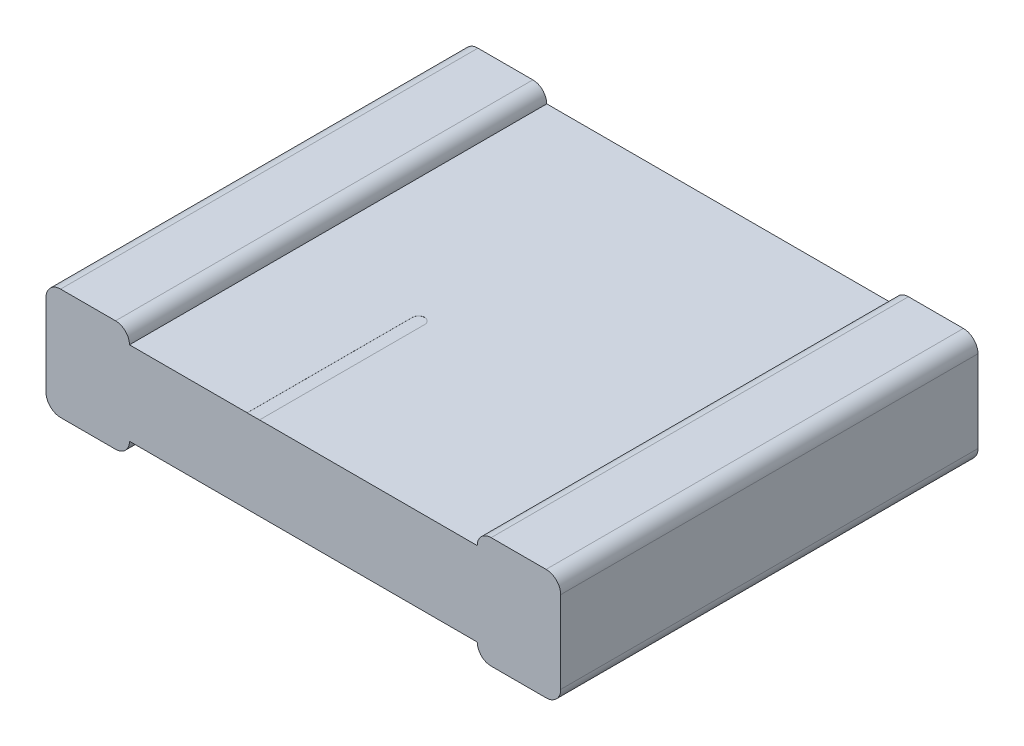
ISO-10303-21;
HEADER;
FILE_DESCRIPTION(('STEP AP214'),'2;1');
FILE_NAME('part.step','',(''),(''),'','','');
FILE_SCHEMA(('AUTOMOTIVE_DESIGN { 1 0 10303 214 1 1 1 1 }'));
ENDSEC;
DATA;
#1=APPLICATION_CONTEXT('core data for automotive mechanical design processes');
#2=APPLICATION_PROTOCOL_DEFINITION('international standard','automotive_design',2000,#1);
#3=PRODUCT_CONTEXT('',#1,'mechanical');
#4=PRODUCT('Part','Part','',(#3));
#5=PRODUCT_RELATED_PRODUCT_CATEGORY('part','',(#4));
#6=PRODUCT_DEFINITION_FORMATION('','',#4);
#7=PRODUCT_DEFINITION_CONTEXT('part definition',#1,'design');
#8=PRODUCT_DEFINITION('design','',#6,#7);
#9=PRODUCT_DEFINITION_SHAPE('','',#8);
#10=(LENGTH_UNIT() NAMED_UNIT(*) SI_UNIT(.MILLI.,.METRE.));
#11=(NAMED_UNIT(*) PLANE_ANGLE_UNIT() SI_UNIT($,.RADIAN.));
#12=(NAMED_UNIT(*) SI_UNIT($,.STERADIAN.) SOLID_ANGLE_UNIT());
#13=UNCERTAINTY_MEASURE_WITH_UNIT(LENGTH_MEASURE(1.E-05),#10,'distance_accuracy_value','');
#14=(GEOMETRIC_REPRESENTATION_CONTEXT(3) GLOBAL_UNCERTAINTY_ASSIGNED_CONTEXT((#13)) GLOBAL_UNIT_ASSIGNED_CONTEXT((#10,
#11,#12)) REPRESENTATION_CONTEXT('',''));
#15=CARTESIAN_POINT('',(0.,0.,0.));
#16=DIRECTION('',(0.,0.,1.));
#17=DIRECTION('',(1.,0.,0.));
#18=AXIS2_PLACEMENT_3D('',#15,#16,#17);
#19=CARTESIAN_POINT('',(0.,0.,0.));
#20=DIRECTION('',(0.,1.,0.));
#21=DIRECTION('',(0.,0.,1.));
#22=AXIS2_PLACEMENT_3D('',#19,#20,#21);
#23=PLANE('',#22);
#24=DIRECTION('',(0.,0.,1.));
#25=VECTOR('',#24,1.);
#26=CARTESIAN_POINT('',(0.635,0.,-0.762));
#27=LINE('',#26,#25);
#28=CARTESIAN_POINT('',(0.635,0.,0.762));
#29=VERTEX_POINT('',#28);
#30=CARTESIAN_POINT('',(0.635,0.,-0.762));
#31=VERTEX_POINT('',#30);
#32=EDGE_CURVE('E377',#29,#31,#27,.F.);
#33=ORIENTED_EDGE('',*,*,#32,.F.);
#34=DIRECTION('',(1.,0.,0.));
#35=VECTOR('',#34,1.);
#36=CARTESIAN_POINT('',(-0.889,0.,0.762));
#37=LINE('',#36,#35);
#38=CARTESIAN_POINT('',(-0.635,0.,0.762));
#39=VERTEX_POINT('',#38);
#40=EDGE_CURVE('E475',#39,#29,#37,.T.);
#41=ORIENTED_EDGE('',*,*,#40,.F.);
#42=DIRECTION('',(0.,0.,1.));
#43=VECTOR('',#42,1.);
#44=CARTESIAN_POINT('',(-0.635,0.,-0.762));
#45=LINE('',#44,#43);
#46=CARTESIAN_POINT('',(-0.635,0.,-0.762));
#47=VERTEX_POINT('',#46);
#48=EDGE_CURVE('E463',#47,#39,#45,.T.);
#49=ORIENTED_EDGE('',*,*,#48,.F.);
#50=DIRECTION('',(-1.,0.,0.));
#51=VECTOR('',#50,1.);
#52=CARTESIAN_POINT('',(-0.889,0.,-0.762));
#53=LINE('',#52,#51);
#54=EDGE_CURVE('E478',#31,#47,#53,.T.);
#55=ORIENTED_EDGE('',*,*,#54,.F.);
#56=EDGE_LOOP('',(#33,#41,#49,#55));
#57=FACE_BOUND('',#56,.T.);
#58=ADVANCED_FACE('F14',(#57),#23,.F.);
#59=CARTESIAN_POINT('',(-0.889,0.3048,0.762));
#60=DIRECTION('',(0.,0.,-1.));
#61=DIRECTION('',(-1.,0.,0.));
#62=AXIS2_PLACEMENT_3D('',#59,#60,#61);
#63=PLANE('',#62);
#64=DIRECTION('',(1.,0.,0.));
#65=VECTOR('',#64,1.);
#66=CARTESIAN_POINT('',(-0.88646,-0.0508,0.762));
#67=LINE('',#66,#65);
#68=CARTESIAN_POINT('',(-0.88646,-0.0508,0.762));
#69=VERTEX_POINT('',#68);
#70=CARTESIAN_POINT('',(-0.6858,-0.0508000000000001,0.762));
#71=VERTEX_POINT('',#70);
#72=EDGE_CURVE('E427',#69,#71,#67,.T.);
#73=ORIENTED_EDGE('',*,*,#72,.T.);
#74=CARTESIAN_POINT('',(-0.6858,0.,0.762));
#75=DIRECTION('',(0.,0.,-1.));
#76=DIRECTION('',(-1.,0.,0.));
#77=AXIS2_PLACEMENT_3D('',#74,#75,#76);
#78=CIRCLE('',#77,0.0508);
#79=EDGE_CURVE('E488',#71,#39,#78,.F.);
#80=ORIENTED_EDGE('',*,*,#79,.T.);
#81=ORIENTED_EDGE('',*,*,#40,.T.);
#82=CARTESIAN_POINT('',(0.6858,0.,0.762));
#83=DIRECTION('',(0.,0.,-1.));
#84=DIRECTION('',(-1.,0.,0.));
#85=AXIS2_PLACEMENT_3D('',#82,#83,#84);
#86=CIRCLE('',#85,0.0508);
#87=CARTESIAN_POINT('',(0.6858,-0.0508000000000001,0.762));
#88=VERTEX_POINT('',#87);
#89=EDGE_CURVE('E490',#29,#88,#86,.F.);
#90=ORIENTED_EDGE('',*,*,#89,.T.);
#91=DIRECTION('',(-1.,0.,0.));
#92=VECTOR('',#91,1.);
#93=CARTESIAN_POINT('',(0.88646,-0.0508,0.762));
#94=LINE('',#93,#92);
#95=CARTESIAN_POINT('',(0.88646,-0.0507999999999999,0.762));
#96=VERTEX_POINT('',#95);
#97=EDGE_CURVE('E346',#96,#88,#94,.T.);
#98=ORIENTED_EDGE('',*,*,#97,.F.);
#99=CARTESIAN_POINT('',(0.88646,0.00254000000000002,0.762));
#100=DIRECTION('',(0.,0.,-1.));
#101=DIRECTION('',(1.,0.,0.));
#102=AXIS2_PLACEMENT_3D('',#99,#100,#101);
#103=CIRCLE('',#102,0.0533399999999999);
#104=CARTESIAN_POINT('',(0.9398,0.00254000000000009,0.762));
#105=VERTEX_POINT('',#104);
#106=EDGE_CURVE('E370',#105,#96,#103,.T.);
#107=ORIENTED_EDGE('',*,*,#106,.F.);
#108=DIRECTION('',(0.,-1.,0.));
#109=VECTOR('',#108,1.);
#110=CARTESIAN_POINT('',(0.9398,0.30226,0.762));
#111=LINE('',#110,#109);
#112=CARTESIAN_POINT('',(0.939799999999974,0.30226,0.762));
#113=VERTEX_POINT('',#112);
#114=EDGE_CURVE('E363',#113,#105,#111,.T.);
#115=ORIENTED_EDGE('',*,*,#114,.F.);
#116=CARTESIAN_POINT('',(0.88646,0.30226,0.762));
#117=DIRECTION('',(0.,0.,-1.));
#118=DIRECTION('',(2.37817124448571E-13,1.,0.));
#119=AXIS2_PLACEMENT_3D('',#116,#117,#118);
#120=CIRCLE('',#119,0.0533399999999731);
#121=CARTESIAN_POINT('',(0.88646,0.3556,0.762));
#122=VERTEX_POINT('',#121);
#123=EDGE_CURVE('E356',#122,#113,#120,.T.);
#124=ORIENTED_EDGE('',*,*,#123,.F.);
#125=DIRECTION('',(1.,0.,0.));
#126=VECTOR('',#125,1.);
#127=CARTESIAN_POINT('',(0.635,0.3556,0.762));
#128=LINE('',#127,#126);
#129=CARTESIAN_POINT('',(0.685799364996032,0.3556,0.762));
#130=VERTEX_POINT('',#129);
#131=EDGE_CURVE('E351',#130,#122,#128,.T.);
#132=ORIENTED_EDGE('',*,*,#131,.F.);
#133=CARTESIAN_POINT('',(0.685799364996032,0.3048,0.762));
#134=DIRECTION('',(0.,0.,-1.));
#135=DIRECTION('',(-1.,0.,0.));
#136=AXIS2_PLACEMENT_3D('',#133,#134,#135);
#137=CIRCLE('',#136,0.0508);
#138=CARTESIAN_POINT('',(0.635,0.305054,0.762));
#139=VERTEX_POINT('',#138);
#140=EDGE_CURVE('E482',#130,#139,#137,.F.);
#141=ORIENTED_EDGE('',*,*,#140,.T.);
#142=DIRECTION('',(1.,0.,0.));
#143=VECTOR('',#142,1.);
#144=CARTESIAN_POINT('',(0.635,0.305054,0.762));
#145=LINE('',#144,#143);
#146=CARTESIAN_POINT('',(-0.160003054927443,0.305054,0.762));
#147=VERTEX_POINT('',#146);
#148=EDGE_CURVE('E293',#147,#139,#145,.T.);
#149=ORIENTED_EDGE('',*,*,#148,.F.);
#150=DIRECTION('',(0.,-1.,0.));
#151=VECTOR('',#150,1.);
#152=CARTESIAN_POINT('',(-0.160003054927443,3.37217630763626,0.762));
#153=LINE('',#152,#151);
#154=CARTESIAN_POINT('',(-0.160003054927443,0.3048,0.762));
#155=VERTEX_POINT('',#154);
#156=EDGE_CURVE('E543',#147,#155,#153,.T.);
#157=ORIENTED_EDGE('',*,*,#156,.T.);
#158=DIRECTION('',(1.,0.,0.));
#159=VECTOR('',#158,1.);
#160=CARTESIAN_POINT('',(0.635,0.3048,0.762));
#161=LINE('',#160,#159);
#162=CARTESIAN_POINT('',(-0.205099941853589,0.3048,0.762));
#163=VERTEX_POINT('',#162);
#164=EDGE_CURVE('E276',#163,#155,#161,.T.);
#165=ORIENTED_EDGE('',*,*,#164,.F.);
#166=DIRECTION('',(0.,-1.,0.));
#167=VECTOR('',#166,1.);
#168=CARTESIAN_POINT('',(-0.205099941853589,3.37217630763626,0.762));
#169=LINE('',#168,#167);
#170=CARTESIAN_POINT('',(-0.205099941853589,0.305054,0.762));
#171=VERTEX_POINT('',#170);
#172=EDGE_CURVE('E267',#171,#163,#169,.T.);
#173=ORIENTED_EDGE('',*,*,#172,.F.);
#174=CARTESIAN_POINT('',(-0.635,0.305054,0.762));
#175=VERTEX_POINT('',#174);
#176=EDGE_CURVE('E282',#175,#171,#145,.T.);
#177=ORIENTED_EDGE('',*,*,#176,.F.);
#178=CARTESIAN_POINT('',(-0.685799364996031,0.3048,0.762));
#179=DIRECTION('',(0.,0.,-1.));
#180=DIRECTION('',(-1.,0.,0.));
#181=AXIS2_PLACEMENT_3D('',#178,#179,#180);
#182=CIRCLE('',#181,0.0508);
#183=CARTESIAN_POINT('',(-0.685799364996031,0.3556,0.762));
#184=VERTEX_POINT('',#183);
#185=EDGE_CURVE('E485',#175,#184,#182,.F.);
#186=ORIENTED_EDGE('',*,*,#185,.T.);
#187=DIRECTION('',(-1.,0.,0.));
#188=VECTOR('',#187,1.);
#189=CARTESIAN_POINT('',(-0.635,0.3556,0.762));
#190=LINE('',#189,#188);
#191=CARTESIAN_POINT('',(-0.88646,0.3556,0.762));
#192=VERTEX_POINT('',#191);
#193=EDGE_CURVE('E393',#184,#192,#190,.T.);
#194=ORIENTED_EDGE('',*,*,#193,.T.);
#195=CARTESIAN_POINT('',(-0.88646,0.30226,0.762));
#196=DIRECTION('',(0.,0.,1.));
#197=DIRECTION('',(-2.39849749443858E-13,1.,0.));
#198=AXIS2_PLACEMENT_3D('',#195,#196,#197);
#199=CIRCLE('',#198,0.0533399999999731);
#200=CARTESIAN_POINT('',(-0.939799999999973,0.30226,0.762));
#201=VERTEX_POINT('',#200);
#202=EDGE_CURVE('E401',#192,#201,#199,.T.);
#203=ORIENTED_EDGE('',*,*,#202,.T.);
#204=DIRECTION('',(0.,-1.,0.));
#205=VECTOR('',#204,1.);
#206=CARTESIAN_POINT('',(-0.9398,0.30226,0.762));
#207=LINE('',#206,#205);
#208=CARTESIAN_POINT('',(-0.9398,0.00254000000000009,0.762));
#209=VERTEX_POINT('',#208);
#210=EDGE_CURVE('E411',#201,#209,#207,.T.);
#211=ORIENTED_EDGE('',*,*,#210,.T.);
#212=CARTESIAN_POINT('',(-0.88646,0.00254000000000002,0.762));
#213=DIRECTION('',(0.,0.,1.));
#214=DIRECTION('',(-1.,0.,0.));
#215=AXIS2_PLACEMENT_3D('',#212,#213,#214);
#216=CIRCLE('',#215,0.05334);
#217=EDGE_CURVE('E421',#209,#69,#216,.T.);
#218=ORIENTED_EDGE('',*,*,#217,.T.);
#219=EDGE_LOOP('',(#73,#80,#81,#90,#98,#107,#115,#124,#132,#141,#149,#157,#165,#173,#177,#186,
#194,#203,#211,#218));
#220=FACE_BOUND('',#219,.T.);
#221=ADVANCED_FACE('F281',(#220),#63,.F.);
#222=CARTESIAN_POINT('',(-0.889,0.3048,-0.762));
#223=DIRECTION('',(0.,0.,1.));
#224=DIRECTION('',(1.,0.,0.));
#225=AXIS2_PLACEMENT_3D('',#222,#223,#224);
#226=PLANE('',#225);
#227=DIRECTION('',(-1.,0.,0.));
#228=VECTOR('',#227,1.);
#229=CARTESIAN_POINT('',(0.88646,-0.0508,-0.762));
#230=LINE('',#229,#228);
#231=CARTESIAN_POINT('',(0.88646,-0.0507999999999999,-0.762));
#232=VERTEX_POINT('',#231);
#233=CARTESIAN_POINT('',(0.6858,-0.0508000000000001,-0.762));
#234=VERTEX_POINT('',#233);
#235=EDGE_CURVE('E342',#232,#234,#230,.T.);
#236=ORIENTED_EDGE('',*,*,#235,.T.);
#237=CARTESIAN_POINT('',(0.6858,0.,-0.762));
#238=DIRECTION('',(0.,0.,1.));
#239=DIRECTION('',(1.,0.,0.));
#240=AXIS2_PLACEMENT_3D('',#237,#238,#239);
#241=CIRCLE('',#240,0.0508);
#242=EDGE_CURVE('E503',#234,#31,#241,.F.);
#243=ORIENTED_EDGE('',*,*,#242,.T.);
#244=ORIENTED_EDGE('',*,*,#54,.T.);
#245=CARTESIAN_POINT('',(-0.6858,0.,-0.762));
#246=DIRECTION('',(0.,0.,1.));
#247=DIRECTION('',(1.,0.,0.));
#248=AXIS2_PLACEMENT_3D('',#245,#246,#247);
#249=CIRCLE('',#248,0.0508);
#250=CARTESIAN_POINT('',(-0.6858,-0.0508000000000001,-0.762));
#251=VERTEX_POINT('',#250);
#252=EDGE_CURVE('E500',#47,#251,#249,.F.);
#253=ORIENTED_EDGE('',*,*,#252,.T.);
#254=DIRECTION('',(1.,0.,0.));
#255=VECTOR('',#254,1.);
#256=CARTESIAN_POINT('',(-0.88646,-0.0508,-0.762));
#257=LINE('',#256,#255);
#258=CARTESIAN_POINT('',(-0.88646,-0.0508,-0.762));
#259=VERTEX_POINT('',#258);
#260=EDGE_CURVE('E431',#259,#251,#257,.T.);
#261=ORIENTED_EDGE('',*,*,#260,.F.);
#262=CARTESIAN_POINT('',(-0.88646,0.00254000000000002,-0.762));
#263=DIRECTION('',(0.,0.,1.));
#264=DIRECTION('',(-1.,0.,0.));
#265=AXIS2_PLACEMENT_3D('',#262,#263,#264);
#266=CIRCLE('',#265,0.05334);
#267=CARTESIAN_POINT('',(-0.9398,0.00254000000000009,-0.762));
#268=VERTEX_POINT('',#267);
#269=EDGE_CURVE('E456',#268,#259,#266,.T.);
#270=ORIENTED_EDGE('',*,*,#269,.F.);
#271=DIRECTION('',(0.,-1.,0.));
#272=VECTOR('',#271,1.);
#273=CARTESIAN_POINT('',(-0.9398,0.30226,-0.762));
#274=LINE('',#273,#272);
#275=CARTESIAN_POINT('',(-0.939799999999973,0.30226,-0.762));
#276=VERTEX_POINT('',#275);
#277=EDGE_CURVE('E449',#276,#268,#274,.T.);
#278=ORIENTED_EDGE('',*,*,#277,.F.);
#279=CARTESIAN_POINT('',(-0.88646,0.30226,-0.762));
#280=DIRECTION('',(0.,0.,1.));
#281=DIRECTION('',(-2.39849749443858E-13,1.,0.));
#282=AXIS2_PLACEMENT_3D('',#279,#280,#281);
#283=CIRCLE('',#282,0.0533399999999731);
#284=CARTESIAN_POINT('',(-0.88646,0.3556,-0.762));
#285=VERTEX_POINT('',#284);
#286=EDGE_CURVE('E442',#285,#276,#283,.T.);
#287=ORIENTED_EDGE('',*,*,#286,.F.);
#288=DIRECTION('',(-1.,0.,0.));
#289=VECTOR('',#288,1.);
#290=CARTESIAN_POINT('',(-0.635,0.3556,-0.762));
#291=LINE('',#290,#289);
#292=CARTESIAN_POINT('',(-0.685799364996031,0.3556,-0.762));
#293=VERTEX_POINT('',#292);
#294=EDGE_CURVE('E436',#293,#285,#291,.T.);
#295=ORIENTED_EDGE('',*,*,#294,.F.);
#296=CARTESIAN_POINT('',(-0.685799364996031,0.3048,-0.762));
#297=DIRECTION('',(0.,0.,1.));
#298=DIRECTION('',(1.,0.,0.));
#299=AXIS2_PLACEMENT_3D('',#296,#297,#298);
#300=CIRCLE('',#299,0.0508);
#301=CARTESIAN_POINT('',(-0.635,0.305054,-0.762));
#302=VERTEX_POINT('',#301);
#303=EDGE_CURVE('E45',#293,#302,#300,.F.);
#304=ORIENTED_EDGE('',*,*,#303,.T.);
#305=DIRECTION('',(-1.,0.,0.));
#306=VECTOR('',#305,1.);
#307=CARTESIAN_POINT('',(0.635,0.305054,-0.762));
#308=LINE('',#307,#306);
#309=CARTESIAN_POINT('',(0.635,0.305054,-0.762));
#310=VERTEX_POINT('',#309);
#311=EDGE_CURVE('E525',#310,#302,#308,.T.);
#312=ORIENTED_EDGE('',*,*,#311,.F.);
#313=CARTESIAN_POINT('',(0.685799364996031,0.3048,-0.762));
#314=DIRECTION('',(0.,0.,1.));
#315=DIRECTION('',(1.,0.,0.));
#316=AXIS2_PLACEMENT_3D('',#313,#314,#315);
#317=CIRCLE('',#316,0.0508);
#318=CARTESIAN_POINT('',(0.685799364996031,0.3556,-0.762));
#319=VERTEX_POINT('',#318);
#320=EDGE_CURVE('E35',#310,#319,#317,.F.);
#321=ORIENTED_EDGE('',*,*,#320,.T.);
#322=DIRECTION('',(1.,0.,0.));
#323=VECTOR('',#322,1.);
#324=CARTESIAN_POINT('',(0.635,0.3556,-0.762));
#325=LINE('',#324,#323);
#326=CARTESIAN_POINT('',(0.88646,0.3556,-0.762));
#327=VERTEX_POINT('',#326);
#328=EDGE_CURVE('E302',#319,#327,#325,.T.);
#329=ORIENTED_EDGE('',*,*,#328,.T.);
#330=CARTESIAN_POINT('',(0.88646,0.30226,-0.762));
#331=DIRECTION('',(0.,0.,-1.));
#332=DIRECTION('',(2.39849749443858E-13,1.,0.));
#333=AXIS2_PLACEMENT_3D('',#330,#331,#332);
#334=CIRCLE('',#333,0.0533399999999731);
#335=CARTESIAN_POINT('',(0.939799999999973,0.30226,-0.762));
#336=VERTEX_POINT('',#335);
#337=EDGE_CURVE('E316',#327,#336,#334,.T.);
#338=ORIENTED_EDGE('',*,*,#337,.T.);
#339=DIRECTION('',(0.,-1.,0.));
#340=VECTOR('',#339,1.);
#341=CARTESIAN_POINT('',(0.9398,0.30226,-0.762));
#342=LINE('',#341,#340);
#343=CARTESIAN_POINT('',(0.9398,0.00254000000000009,-0.762));
#344=VERTEX_POINT('',#343);
#345=EDGE_CURVE('E326',#336,#344,#342,.T.);
#346=ORIENTED_EDGE('',*,*,#345,.T.);
#347=CARTESIAN_POINT('',(0.88646,0.00254000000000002,-0.762));
#348=DIRECTION('',(0.,0.,-1.));
#349=DIRECTION('',(1.,0.,0.));
#350=AXIS2_PLACEMENT_3D('',#347,#348,#349);
#351=CIRCLE('',#350,0.0533399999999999);
#352=EDGE_CURVE('E336',#344,#232,#351,.T.);
#353=ORIENTED_EDGE('',*,*,#352,.T.);
#354=EDGE_LOOP('',(#236,#243,#244,#253,#261,#270,#278,#287,#295,#304,#312,#321,#329,#338,#346,#353));
#355=FACE_BOUND('',#354,.T.);
#356=ADVANCED_FACE('F518',(#355),#226,.F.);
#357=CARTESIAN_POINT('',(-0.635,0.3556,-0.762));
#358=DIRECTION('',(0.,1.,0.));
#359=DIRECTION('',(-1.,0.,0.));
#360=AXIS2_PLACEMENT_3D('',#357,#358,#359);
#361=PLANE('',#360);
#362=ORIENTED_EDGE('',*,*,#193,.F.);
#363=DIRECTION('',(0.,0.,1.));
#364=VECTOR('',#363,1.);
#365=CARTESIAN_POINT('',(-0.685799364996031,0.3556,-0.762));
#366=LINE('',#365,#364);
#367=EDGE_CURVE('E23',#184,#293,#366,.F.);
#368=ORIENTED_EDGE('',*,*,#367,.T.);
#369=ORIENTED_EDGE('',*,*,#294,.T.);
#370=DIRECTION('',(0.,0.,-1.));
#371=VECTOR('',#370,1.);
#372=CARTESIAN_POINT('',(-0.88646,0.3556,-0.762));
#373=LINE('',#372,#371);
#374=EDGE_CURVE('E396',#192,#285,#373,.T.);
#375=ORIENTED_EDGE('',*,*,#374,.F.);
#376=EDGE_LOOP('',(#362,#368,#369,#375));
#377=FACE_BOUND('',#376,.T.);
#378=ADVANCED_FACE('F514',(#377),#361,.T.);
#379=CARTESIAN_POINT('',(-0.88646,0.30226,-0.762));
#380=DIRECTION('',(0.,0.,1.));
#381=DIRECTION('',(1.,0.,0.));
#382=AXIS2_PLACEMENT_3D('',#379,#380,#381);
#383=CYLINDRICAL_SURFACE('',#382,0.0533399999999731);
#384=ORIENTED_EDGE('',*,*,#286,.T.);
#385=DIRECTION('',(0.,0.,-1.));
#386=VECTOR('',#385,1.);
#387=CARTESIAN_POINT('',(-0.9398,0.30226,-0.762));
#388=LINE('',#387,#386);
#389=EDGE_CURVE('E406',#201,#276,#388,.T.);
#390=ORIENTED_EDGE('',*,*,#389,.F.);
#391=ORIENTED_EDGE('',*,*,#202,.F.);
#392=ORIENTED_EDGE('',*,*,#374,.T.);
#393=EDGE_LOOP('',(#384,#390,#391,#392));
#394=FACE_BOUND('',#393,.T.);
#395=ADVANCED_FACE('F521',(#394),#383,.T.);
#396=CARTESIAN_POINT('',(-0.9398,0.30226,-0.762));
#397=DIRECTION('',(-1.,0.,0.));
#398=DIRECTION('',(0.,0.,1.));
#399=AXIS2_PLACEMENT_3D('',#396,#397,#398);
#400=PLANE('',#399);
#401=ORIENTED_EDGE('',*,*,#277,.T.);
#402=DIRECTION('',(0.,0.,-1.));
#403=VECTOR('',#402,1.);
#404=CARTESIAN_POINT('',(-0.9398,0.00254000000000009,-0.762));
#405=LINE('',#404,#403);
#406=EDGE_CURVE('E416',#209,#268,#405,.T.);
#407=ORIENTED_EDGE('',*,*,#406,.F.);
#408=ORIENTED_EDGE('',*,*,#210,.F.);
#409=ORIENTED_EDGE('',*,*,#389,.T.);
#410=EDGE_LOOP('',(#401,#407,#408,#409));
#411=FACE_BOUND('',#410,.T.);
#412=ADVANCED_FACE('F610',(#411),#400,.T.);
#413=CARTESIAN_POINT('',(-0.88646,0.00254000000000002,-0.762));
#414=DIRECTION('',(0.,0.,1.));
#415=DIRECTION('',(1.,0.,0.));
#416=AXIS2_PLACEMENT_3D('',#413,#414,#415);
#417=CYLINDRICAL_SURFACE('',#416,0.05334);
#418=ORIENTED_EDGE('',*,*,#269,.T.);
#419=DIRECTION('',(0.,0.,-1.));
#420=VECTOR('',#419,1.);
#421=CARTESIAN_POINT('',(-0.88646,-0.0507999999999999,-0.762));
#422=LINE('',#421,#420);
#423=EDGE_CURVE('E426',#69,#259,#422,.T.);
#424=ORIENTED_EDGE('',*,*,#423,.F.);
#425=ORIENTED_EDGE('',*,*,#217,.F.);
#426=ORIENTED_EDGE('',*,*,#406,.T.);
#427=EDGE_LOOP('',(#418,#424,#425,#426));
#428=FACE_BOUND('',#427,.T.);
#429=ADVANCED_FACE('F607',(#428),#417,.T.);
#430=CARTESIAN_POINT('',(-0.88646,-0.0508,-0.762));
#431=DIRECTION('',(0.,-1.,0.));
#432=DIRECTION('',(1.,0.,0.));
#433=AXIS2_PLACEMENT_3D('',#430,#431,#432);
#434=PLANE('',#433);
#435=ORIENTED_EDGE('',*,*,#260,.T.);
#436=DIRECTION('',(0.,0.,-1.));
#437=VECTOR('',#436,1.);
#438=CARTESIAN_POINT('',(-0.6858,-0.0508000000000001,0.762));
#439=LINE('',#438,#437);
#440=EDGE_CURVE('E506',#251,#71,#439,.F.);
#441=ORIENTED_EDGE('',*,*,#440,.T.);
#442=ORIENTED_EDGE('',*,*,#72,.F.);
#443=ORIENTED_EDGE('',*,*,#423,.T.);
#444=EDGE_LOOP('',(#435,#441,#442,#443));
#445=FACE_BOUND('',#444,.T.);
#446=ADVANCED_FACE('F604',(#445),#434,.T.);
#447=CARTESIAN_POINT('',(0.635,0.3556,-0.762));
#448=DIRECTION('',(0.,1.,0.));
#449=DIRECTION('',(-1.,0.,0.));
#450=AXIS2_PLACEMENT_3D('',#447,#448,#449);
#451=PLANE('',#450);
#452=ORIENTED_EDGE('',*,*,#328,.F.);
#453=DIRECTION('',(0.,0.,-1.));
#454=VECTOR('',#453,1.);
#455=CARTESIAN_POINT('',(0.685799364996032,0.3556,0.762));
#456=LINE('',#455,#454);
#457=EDGE_CURVE('E9',#319,#130,#456,.F.);
#458=ORIENTED_EDGE('',*,*,#457,.T.);
#459=ORIENTED_EDGE('',*,*,#131,.T.);
#460=DIRECTION('',(0.,0.,-1.));
#461=VECTOR('',#460,1.);
#462=CARTESIAN_POINT('',(0.88646,0.3556,-0.762));
#463=LINE('',#462,#461);
#464=EDGE_CURVE('E311',#327,#122,#463,.F.);
#465=ORIENTED_EDGE('',*,*,#464,.F.);
#466=EDGE_LOOP('',(#452,#458,#459,#465));
#467=FACE_BOUND('',#466,.T.);
#468=ADVANCED_FACE('F577',(#467),#451,.T.);
#469=CARTESIAN_POINT('',(0.88646,0.30226,-0.762));
#470=DIRECTION('',(0.,0.,-1.));
#471=DIRECTION('',(-1.,0.,0.));
#472=AXIS2_PLACEMENT_3D('',#469,#470,#471);
#473=CYLINDRICAL_SURFACE('',#472,0.0533399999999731);
#474=ORIENTED_EDGE('',*,*,#123,.T.);
#475=DIRECTION('',(0.,0.,-1.));
#476=VECTOR('',#475,1.);
#477=CARTESIAN_POINT('',(0.9398,0.30226,-0.762));
#478=LINE('',#477,#476);
#479=EDGE_CURVE('E321',#336,#113,#478,.F.);
#480=ORIENTED_EDGE('',*,*,#479,.F.);
#481=ORIENTED_EDGE('',*,*,#337,.F.);
#482=ORIENTED_EDGE('',*,*,#464,.T.);
#483=EDGE_LOOP('',(#474,#480,#481,#482));
#484=FACE_BOUND('',#483,.T.);
#485=ADVANCED_FACE('F583',(#484),#473,.T.);
#486=CARTESIAN_POINT('',(0.9398,0.30226,-0.762));
#487=DIRECTION('',(1.,0.,0.));
#488=DIRECTION('',(0.,0.,-1.));
#489=AXIS2_PLACEMENT_3D('',#486,#487,#488);
#490=PLANE('',#489);
#491=ORIENTED_EDGE('',*,*,#114,.T.);
#492=DIRECTION('',(0.,0.,-1.));
#493=VECTOR('',#492,1.);
#494=CARTESIAN_POINT('',(0.9398,0.00254000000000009,-0.762));
#495=LINE('',#494,#493);
#496=EDGE_CURVE('E331',#344,#105,#495,.F.);
#497=ORIENTED_EDGE('',*,*,#496,.F.);
#498=ORIENTED_EDGE('',*,*,#345,.F.);
#499=ORIENTED_EDGE('',*,*,#479,.T.);
#500=EDGE_LOOP('',(#491,#497,#498,#499));
#501=FACE_BOUND('',#500,.T.);
#502=ADVANCED_FACE('F659',(#501),#490,.T.);
#503=CARTESIAN_POINT('',(0.88646,0.00254000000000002,-0.762));
#504=DIRECTION('',(0.,0.,-1.));
#505=DIRECTION('',(-1.,0.,0.));
#506=AXIS2_PLACEMENT_3D('',#503,#504,#505);
#507=CYLINDRICAL_SURFACE('',#506,0.0533399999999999);
#508=ORIENTED_EDGE('',*,*,#106,.T.);
#509=DIRECTION('',(0.,0.,-1.));
#510=VECTOR('',#509,1.);
#511=CARTESIAN_POINT('',(0.88646,-0.0507999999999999,-0.762));
#512=LINE('',#511,#510);
#513=EDGE_CURVE('E341',#232,#96,#512,.F.);
#514=ORIENTED_EDGE('',*,*,#513,.F.);
#515=ORIENTED_EDGE('',*,*,#352,.F.);
#516=ORIENTED_EDGE('',*,*,#496,.T.);
#517=EDGE_LOOP('',(#508,#514,#515,#516));
#518=FACE_BOUND('',#517,.T.);
#519=ADVANCED_FACE('F663',(#518),#507,.T.);
#520=CARTESIAN_POINT('',(0.88646,-0.0508,-0.762));
#521=DIRECTION('',(0.,-1.,0.));
#522=DIRECTION('',(1.,0.,0.));
#523=AXIS2_PLACEMENT_3D('',#520,#521,#522);
#524=PLANE('',#523);
#525=ORIENTED_EDGE('',*,*,#97,.T.);
#526=DIRECTION('',(0.,0.,1.));
#527=VECTOR('',#526,1.);
#528=CARTESIAN_POINT('',(0.6858,-0.0508000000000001,-0.762));
#529=LINE('',#528,#527);
#530=EDGE_CURVE('E493',#88,#234,#529,.F.);
#531=ORIENTED_EDGE('',*,*,#530,.T.);
#532=ORIENTED_EDGE('',*,*,#235,.F.);
#533=ORIENTED_EDGE('',*,*,#513,.T.);
#534=EDGE_LOOP('',(#525,#531,#532,#533));
#535=FACE_BOUND('',#534,.T.);
#536=ADVANCED_FACE('F695',(#535),#524,.T.);
#537=CARTESIAN_POINT('',(0.,0.305054,0.));
#538=DIRECTION('',(0.,-1.,0.));
#539=DIRECTION('',(0.,0.,-1.));
#540=AXIS2_PLACEMENT_3D('',#537,#538,#539);
#541=PLANE('',#540);
#542=ORIENTED_EDGE('',*,*,#176,.T.);
#543=DIRECTION('',(0.,0.,1.));
#544=VECTOR('',#543,1.);
#545=CARTESIAN_POINT('',(-0.205099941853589,0.305054,0.762));
#546=LINE('',#545,#544);
#547=CARTESIAN_POINT('',(-0.205099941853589,0.305054,0.158817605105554));
#548=VERTEX_POINT('',#547);
#549=EDGE_CURVE('E263',#548,#171,#546,.T.);
#550=ORIENTED_EDGE('',*,*,#549,.F.);
#551=CARTESIAN_POINT('',(-0.182551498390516,0.305054,0.158817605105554));
#552=DIRECTION('',(0.,-1.,0.));
#553=DIRECTION('',(0.,0.,-1.));
#554=AXIS2_PLACEMENT_3D('',#551,#552,#553);
#555=CIRCLE('',#554,0.022548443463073);
#556=CARTESIAN_POINT('',(-0.160003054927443,0.305054,0.158817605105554));
#557=VERTEX_POINT('',#556);
#558=EDGE_CURVE('E275',#557,#548,#555,.F.);
#559=ORIENTED_EDGE('',*,*,#558,.F.);
#560=DIRECTION('',(0.,0.,-1.));
#561=VECTOR('',#560,1.);
#562=CARTESIAN_POINT('',(-0.160003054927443,0.305054,0.762));
#563=LINE('',#562,#561);
#564=EDGE_CURVE('E547',#147,#557,#563,.T.);
#565=ORIENTED_EDGE('',*,*,#564,.F.);
#566=ORIENTED_EDGE('',*,*,#148,.T.);
#567=DIRECTION('',(0.,0.,-1.));
#568=VECTOR('',#567,1.);
#569=CARTESIAN_POINT('',(0.635,0.305054,-0.762));
#570=LINE('',#569,#568);
#571=EDGE_CURVE('E286',#139,#310,#570,.T.);
#572=ORIENTED_EDGE('',*,*,#571,.T.);
#573=ORIENTED_EDGE('',*,*,#311,.T.);
#574=DIRECTION('',(0.,0.,1.));
#575=VECTOR('',#574,1.);
#576=CARTESIAN_POINT('',(-0.635,0.305054,-0.762));
#577=LINE('',#576,#575);
#578=EDGE_CURVE('E290',#302,#175,#577,.T.);
#579=ORIENTED_EDGE('',*,*,#578,.T.);
#580=EDGE_LOOP('',(#542,#550,#559,#565,#566,#572,#573,#579));
#581=FACE_BOUND('',#580,.T.);
#582=ADVANCED_FACE('F288',(#581),#541,.F.);
#583=CARTESIAN_POINT('',(-0.205099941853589,3.37217630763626,0.762));
#584=DIRECTION('',(-1.,0.,0.));
#585=DIRECTION('',(0.,0.,1.));
#586=AXIS2_PLACEMENT_3D('',#583,#584,#585);
#587=PLANE('',#586);
#588=ORIENTED_EDGE('',*,*,#549,.T.);
#589=ORIENTED_EDGE('',*,*,#172,.T.);
#590=DIRECTION('',(0.,0.,1.));
#591=VECTOR('',#590,1.);
#592=CARTESIAN_POINT('',(-0.205099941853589,0.3048,0.762));
#593=LINE('',#592,#591);
#594=CARTESIAN_POINT('',(-0.205099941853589,0.3048,0.158817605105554));
#595=VERTEX_POINT('',#594);
#596=EDGE_CURVE('E546',#595,#163,#593,.T.);
#597=ORIENTED_EDGE('',*,*,#596,.F.);
#598=DIRECTION('',(0.,-1.,0.));
#599=VECTOR('',#598,1.);
#600=CARTESIAN_POINT('',(-0.205099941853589,3.37217630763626,0.158817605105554));
#601=LINE('',#600,#599);
#602=EDGE_CURVE('E270',#548,#595,#601,.T.);
#603=ORIENTED_EDGE('',*,*,#602,.F.);
#604=EDGE_LOOP('',(#588,#589,#597,#603));
#605=FACE_BOUND('',#604,.T.);
#606=ADVANCED_FACE('F265',(#605),#587,.F.);
#607=CARTESIAN_POINT('',(-0.182551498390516,3.37217630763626,0.158817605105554));
#608=DIRECTION('',(0.,-1.,0.));
#609=DIRECTION('',(0.,0.,-1.));
#610=AXIS2_PLACEMENT_3D('',#607,#608,#609);
#611=CYLINDRICAL_SURFACE('',#610,0.022548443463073);
#612=ORIENTED_EDGE('',*,*,#558,.T.);
#613=ORIENTED_EDGE('',*,*,#602,.T.);
#614=CARTESIAN_POINT('',(-0.182551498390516,0.3048,0.158817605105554));
#615=DIRECTION('',(0.,-1.,0.));
#616=DIRECTION('',(0.,0.,-1.));
#617=AXIS2_PLACEMENT_3D('',#614,#615,#616);
#618=CIRCLE('',#617,0.022548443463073);
#619=CARTESIAN_POINT('',(-0.160003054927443,0.3048,0.158817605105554));
#620=VERTEX_POINT('',#619);
#621=EDGE_CURVE('E553',#620,#595,#618,.F.);
#622=ORIENTED_EDGE('',*,*,#621,.F.);
#623=DIRECTION('',(0.,-1.,0.));
#624=VECTOR('',#623,1.);
#625=CARTESIAN_POINT('',(-0.160003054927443,3.37217630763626,0.158817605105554));
#626=LINE('',#625,#624);
#627=EDGE_CURVE('E539',#557,#620,#626,.T.);
#628=ORIENTED_EDGE('',*,*,#627,.F.);
#629=EDGE_LOOP('',(#612,#613,#622,#628));
#630=FACE_BOUND('',#629,.T.);
#631=ADVANCED_FACE('F567',(#630),#611,.F.);
#632=CARTESIAN_POINT('',(-0.160003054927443,3.37217630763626,0.762));
#633=DIRECTION('',(1.,0.,0.));
#634=DIRECTION('',(0.,0.,-1.));
#635=AXIS2_PLACEMENT_3D('',#632,#633,#634);
#636=PLANE('',#635);
#637=ORIENTED_EDGE('',*,*,#564,.T.);
#638=ORIENTED_EDGE('',*,*,#627,.T.);
#639=DIRECTION('',(0.,0.,-1.));
#640=VECTOR('',#639,1.);
#641=CARTESIAN_POINT('',(-0.160003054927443,0.3048,0.762));
#642=LINE('',#641,#640);
#643=EDGE_CURVE('E550',#155,#620,#642,.T.);
#644=ORIENTED_EDGE('',*,*,#643,.F.);
#645=ORIENTED_EDGE('',*,*,#156,.F.);
#646=EDGE_LOOP('',(#637,#638,#644,#645));
#647=FACE_BOUND('',#646,.T.);
#648=ADVANCED_FACE('F931',(#647),#636,.F.);
#649=CARTESIAN_POINT('',(0.,0.3048,0.));
#650=DIRECTION('',(0.,-1.,0.));
#651=DIRECTION('',(0.,0.,-1.));
#652=AXIS2_PLACEMENT_3D('',#649,#650,#651);
#653=PLANE('',#652);
#654=ORIENTED_EDGE('',*,*,#643,.T.);
#655=ORIENTED_EDGE('',*,*,#621,.T.);
#656=ORIENTED_EDGE('',*,*,#596,.T.);
#657=ORIENTED_EDGE('',*,*,#164,.T.);
#658=EDGE_LOOP('',(#654,#655,#656,#657));
#659=FACE_BOUND('',#658,.T.);
#660=ADVANCED_FACE('F562',(#659),#653,.F.);
#661=CARTESIAN_POINT('',(0.6858,0.,0.));
#662=DIRECTION('',(0.,0.,-1.));
#663=DIRECTION('',(-1.,0.,0.));
#664=AXIS2_PLACEMENT_3D('',#661,#662,#663);
#665=CYLINDRICAL_SURFACE('',#664,0.0508);
#666=ORIENTED_EDGE('',*,*,#242,.F.);
#667=ORIENTED_EDGE('',*,*,#530,.F.);
#668=ORIENTED_EDGE('',*,*,#89,.F.);
#669=ORIENTED_EDGE('',*,*,#32,.T.);
#670=EDGE_LOOP('',(#666,#667,#668,#669));
#671=FACE_BOUND('',#670,.T.);
#672=ADVANCED_FACE('F593',(#671),#665,.T.);
#673=CARTESIAN_POINT('',(-0.6858,0.,0.));
#674=DIRECTION('',(0.,0.,1.));
#675=DIRECTION('',(1.,0.,0.));
#676=AXIS2_PLACEMENT_3D('',#673,#674,#675);
#677=CYLINDRICAL_SURFACE('',#676,0.0508);
#678=ORIENTED_EDGE('',*,*,#79,.F.);
#679=ORIENTED_EDGE('',*,*,#440,.F.);
#680=ORIENTED_EDGE('',*,*,#252,.F.);
#681=ORIENTED_EDGE('',*,*,#48,.T.);
#682=EDGE_LOOP('',(#678,#679,#680,#681));
#683=FACE_BOUND('',#682,.T.);
#684=ADVANCED_FACE('F601',(#683),#677,.T.);
#685=CARTESIAN_POINT('',(-0.685799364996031,0.3048,0.));
#686=DIRECTION('',(0.,0.,-1.));
#687=DIRECTION('',(-1.,0.,0.));
#688=AXIS2_PLACEMENT_3D('',#685,#686,#687);
#689=CYLINDRICAL_SURFACE('',#688,0.0508);
#690=ORIENTED_EDGE('',*,*,#185,.F.);
#691=ORIENTED_EDGE('',*,*,#578,.F.);
#692=ORIENTED_EDGE('',*,*,#303,.F.);
#693=ORIENTED_EDGE('',*,*,#367,.F.);
#694=EDGE_LOOP('',(#690,#691,#692,#693));
#695=FACE_BOUND('',#694,.T.);
#696=ADVANCED_FACE('F523',(#695),#689,.T.);
#697=CARTESIAN_POINT('',(0.685799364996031,0.3048,0.));
#698=DIRECTION('',(0.,0.,1.));
#699=DIRECTION('',(1.,0.,0.));
#700=AXIS2_PLACEMENT_3D('',#697,#698,#699);
#701=CYLINDRICAL_SURFACE('',#700,0.0508);
#702=ORIENTED_EDGE('',*,*,#320,.F.);
#703=ORIENTED_EDGE('',*,*,#571,.F.);
#704=ORIENTED_EDGE('',*,*,#140,.F.);
#705=ORIENTED_EDGE('',*,*,#457,.F.);
#706=EDGE_LOOP('',(#702,#703,#704,#705));
#707=FACE_BOUND('',#706,.T.);
#708=ADVANCED_FACE('F16',(#707),#701,.T.);
#709=CLOSED_SHELL('',(#58,#221,#356,#378,#395,#412,#429,#446,#468,#485,#502,#519,#536,#582,#606,
#631,#648,#660,#672,#684,#696,#708));
#710=MANIFOLD_SOLID_BREP('B1',#709);
#711=ADVANCED_BREP_SHAPE_REPRESENTATION('',(#18,#710),#14);
#712=SHAPE_DEFINITION_REPRESENTATION(#9,#711);
ENDSEC;
END-ISO-10303-21;
